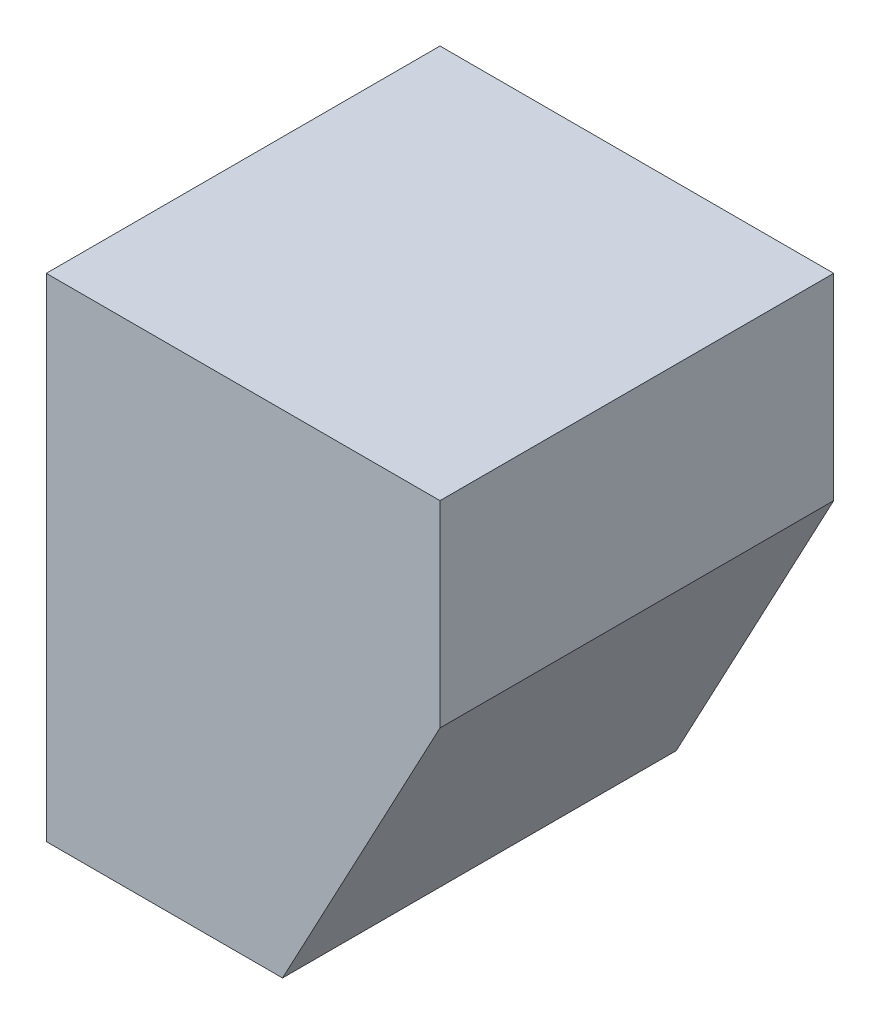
ISO-10303-21;
HEADER;
FILE_DESCRIPTION(('STEP AP214'),'2;1');
FILE_NAME('part.step','',(''),(''),'','','');
FILE_SCHEMA(('AUTOMOTIVE_DESIGN { 1 0 10303 214 1 1 1 1 }'));
ENDSEC;
DATA;
#1=APPLICATION_CONTEXT('core data for automotive mechanical design processes');
#2=APPLICATION_PROTOCOL_DEFINITION('international standard','automotive_design',2000,#1);
#3=PRODUCT_CONTEXT('',#1,'mechanical');
#4=PRODUCT('Part','Part','',(#3));
#5=PRODUCT_RELATED_PRODUCT_CATEGORY('part','',(#4));
#6=PRODUCT_DEFINITION_FORMATION('','',#4);
#7=PRODUCT_DEFINITION_CONTEXT('part definition',#1,'design');
#8=PRODUCT_DEFINITION('design','',#6,#7);
#9=PRODUCT_DEFINITION_SHAPE('','',#8);
#10=(LENGTH_UNIT() NAMED_UNIT(*) SI_UNIT(.MILLI.,.METRE.));
#11=(NAMED_UNIT(*) PLANE_ANGLE_UNIT() SI_UNIT($,.RADIAN.));
#12=(NAMED_UNIT(*) SI_UNIT($,.STERADIAN.) SOLID_ANGLE_UNIT());
#13=UNCERTAINTY_MEASURE_WITH_UNIT(LENGTH_MEASURE(1.E-05),#10,'distance_accuracy_value','');
#14=(GEOMETRIC_REPRESENTATION_CONTEXT(3) GLOBAL_UNCERTAINTY_ASSIGNED_CONTEXT((#13)) GLOBAL_UNIT_ASSIGNED_CONTEXT((#10,
#11,#12)) REPRESENTATION_CONTEXT('',''));
#15=CARTESIAN_POINT('',(0.,0.,0.));
#16=DIRECTION('',(0.,0.,1.));
#17=DIRECTION('',(1.,0.,0.));
#18=AXIS2_PLACEMENT_3D('',#15,#16,#17);
#19=CARTESIAN_POINT('',(-42.8205504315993,18.3170990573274,10.));
#20=DIRECTION('',(0.,1.,0.));
#21=DIRECTION('',(-1.,0.,0.));
#22=AXIS2_PLACEMENT_3D('',#19,#20,#21);
#23=PLANE('',#22);
#24=DIRECTION('',(1.,0.,0.));
#25=VECTOR('',#24,1.);
#26=CARTESIAN_POINT('',(-42.8205504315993,18.3170990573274,-10.));
#27=LINE('',#26,#25);
#28=CARTESIAN_POINT('',(-42.8205504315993,18.3170990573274,-10.));
#29=VERTEX_POINT('',#28);
#30=CARTESIAN_POINT('',(-30.8205504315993,18.3170990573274,-10.));
#31=VERTEX_POINT('',#30);
#32=EDGE_CURVE('E106',#29,#31,#27,.T.);
#33=ORIENTED_EDGE('',*,*,#32,.T.);
#34=DIRECTION('',(0.,0.,-1.));
#35=VECTOR('',#34,1.);
#36=CARTESIAN_POINT('',(-30.8205504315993,18.3170990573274,10.));
#37=LINE('',#36,#35);
#38=CARTESIAN_POINT('',(-30.8205504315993,18.3170990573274,10.));
#39=VERTEX_POINT('',#38);
#40=EDGE_CURVE('E11',#39,#31,#37,.T.);
#41=ORIENTED_EDGE('',*,*,#40,.F.);
#42=DIRECTION('',(1.,0.,0.));
#43=VECTOR('',#42,1.);
#44=CARTESIAN_POINT('',(-42.8205504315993,18.3170990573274,10.));
#45=LINE('',#44,#43);
#46=CARTESIAN_POINT('',(-42.8205504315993,18.3170990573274,10.));
#47=VERTEX_POINT('',#46);
#48=EDGE_CURVE('E114',#47,#39,#45,.T.);
#49=ORIENTED_EDGE('',*,*,#48,.F.);
#50=DIRECTION('',(0.,0.,-1.));
#51=VECTOR('',#50,1.);
#52=CARTESIAN_POINT('',(-42.8205504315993,18.3170990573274,10.));
#53=LINE('',#52,#51);
#54=EDGE_CURVE('E102',#47,#29,#53,.T.);
#55=ORIENTED_EDGE('',*,*,#54,.T.);
#56=EDGE_LOOP('',(#33,#41,#49,#55));
#57=FACE_BOUND('',#56,.T.);
#58=ADVANCED_FACE('F32',(#57),#23,.F.);
#59=CARTESIAN_POINT('',(-30.8205504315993,18.3170990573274,10.));
#60=DIRECTION('',(-0.882352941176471,0.470588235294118,0.));
#61=DIRECTION('',(-0.470588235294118,-0.882352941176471,0.));
#62=AXIS2_PLACEMENT_3D('',#59,#60,#61);
#63=PLANE('',#62);
#64=DIRECTION('',(0.470588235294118,0.882352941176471,0.));
#65=VECTOR('',#64,1.);
#66=CARTESIAN_POINT('',(-30.8205504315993,18.3170990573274,-10.));
#67=LINE('',#66,#65);
#68=CARTESIAN_POINT('',(-22.8205504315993,33.3170990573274,-10.));
#69=VERTEX_POINT('',#68);
#70=EDGE_CURVE('E109',#31,#69,#67,.T.);
#71=ORIENTED_EDGE('',*,*,#70,.T.);
#72=DIRECTION('',(0.,0.,-1.));
#73=VECTOR('',#72,1.);
#74=CARTESIAN_POINT('',(-22.8205504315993,33.3170990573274,10.));
#75=LINE('',#74,#73);
#76=CARTESIAN_POINT('',(-22.8205504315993,33.3170990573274,10.));
#77=VERTEX_POINT('',#76);
#78=EDGE_CURVE('E40',#77,#69,#75,.T.);
#79=ORIENTED_EDGE('',*,*,#78,.F.);
#80=DIRECTION('',(0.470588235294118,0.882352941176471,0.));
#81=VECTOR('',#80,1.);
#82=CARTESIAN_POINT('',(-30.8205504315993,18.3170990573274,10.));
#83=LINE('',#82,#81);
#84=EDGE_CURVE('E82',#39,#77,#83,.T.);
#85=ORIENTED_EDGE('',*,*,#84,.F.);
#86=ORIENTED_EDGE('',*,*,#40,.T.);
#87=EDGE_LOOP('',(#71,#79,#85,#86));
#88=FACE_BOUND('',#87,.T.);
#89=ADVANCED_FACE('F133',(#88),#63,.F.);
#90=CARTESIAN_POINT('',(-22.8205504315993,33.3170990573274,10.));
#91=DIRECTION('',(-1.,0.,0.));
#92=DIRECTION('',(0.,0.,1.));
#93=AXIS2_PLACEMENT_3D('',#90,#91,#92);
#94=PLANE('',#93);
#95=DIRECTION('',(0.,1.,0.));
#96=VECTOR('',#95,1.);
#97=CARTESIAN_POINT('',(-22.8205504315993,33.3170990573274,-10.));
#98=LINE('',#97,#96);
#99=CARTESIAN_POINT('',(-22.8205504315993,43.3170990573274,-10.));
#100=VERTEX_POINT('',#99);
#101=EDGE_CURVE('E97',#69,#100,#98,.T.);
#102=ORIENTED_EDGE('',*,*,#101,.T.);
#103=DIRECTION('',(0.,0.,-1.));
#104=VECTOR('',#103,1.);
#105=CARTESIAN_POINT('',(-22.8205504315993,43.3170990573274,10.));
#106=LINE('',#105,#104);
#107=CARTESIAN_POINT('',(-22.8205504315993,43.3170990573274,10.));
#108=VERTEX_POINT('',#107);
#109=EDGE_CURVE('E94',#108,#100,#106,.T.);
#110=ORIENTED_EDGE('',*,*,#109,.F.);
#111=DIRECTION('',(0.,1.,0.));
#112=VECTOR('',#111,1.);
#113=CARTESIAN_POINT('',(-22.8205504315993,33.3170990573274,10.));
#114=LINE('',#113,#112);
#115=EDGE_CURVE('E86',#77,#108,#114,.T.);
#116=ORIENTED_EDGE('',*,*,#115,.F.);
#117=ORIENTED_EDGE('',*,*,#78,.T.);
#118=EDGE_LOOP('',(#102,#110,#116,#117));
#119=FACE_BOUND('',#118,.T.);
#120=ADVANCED_FACE('F95',(#119),#94,.F.);
#121=CARTESIAN_POINT('',(-22.8205504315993,43.3170990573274,10.));
#122=DIRECTION('',(0.,-1.,0.));
#123=DIRECTION('',(0.,0.,-1.));
#124=AXIS2_PLACEMENT_3D('',#121,#122,#123);
#125=PLANE('',#124);
#126=DIRECTION('',(-1.,0.,0.));
#127=VECTOR('',#126,1.);
#128=CARTESIAN_POINT('',(-22.8205504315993,43.3170990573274,-10.));
#129=LINE('',#128,#127);
#130=CARTESIAN_POINT('',(-42.8205504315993,43.3170990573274,-10.));
#131=VERTEX_POINT('',#130);
#132=EDGE_CURVE('E68',#100,#131,#129,.T.);
#133=ORIENTED_EDGE('',*,*,#132,.T.);
#134=DIRECTION('',(0.,0.,-1.));
#135=VECTOR('',#134,1.);
#136=CARTESIAN_POINT('',(-42.8205504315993,43.3170990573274,10.));
#137=LINE('',#136,#135);
#138=CARTESIAN_POINT('',(-42.8205504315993,43.3170990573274,10.));
#139=VERTEX_POINT('',#138);
#140=EDGE_CURVE('E98',#139,#131,#137,.T.);
#141=ORIENTED_EDGE('',*,*,#140,.F.);
#142=DIRECTION('',(-1.,0.,0.));
#143=VECTOR('',#142,1.);
#144=CARTESIAN_POINT('',(-22.8205504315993,43.3170990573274,10.));
#145=LINE('',#144,#143);
#146=EDGE_CURVE('E90',#108,#139,#145,.T.);
#147=ORIENTED_EDGE('',*,*,#146,.F.);
#148=ORIENTED_EDGE('',*,*,#109,.T.);
#149=EDGE_LOOP('',(#133,#141,#147,#148));
#150=FACE_BOUND('',#149,.T.);
#151=ADVANCED_FACE('F100',(#150),#125,.F.);
#152=CARTESIAN_POINT('',(-42.8205504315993,43.3170990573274,10.));
#153=DIRECTION('',(1.,0.,0.));
#154=DIRECTION('',(0.,1.,0.));
#155=AXIS2_PLACEMENT_3D('',#152,#153,#154);
#156=PLANE('',#155);
#157=DIRECTION('',(0.,-1.,0.));
#158=VECTOR('',#157,1.);
#159=CARTESIAN_POINT('',(-42.8205504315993,43.3170990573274,-10.));
#160=LINE('',#159,#158);
#161=EDGE_CURVE('E74',#131,#29,#160,.T.);
#162=ORIENTED_EDGE('',*,*,#161,.T.);
#163=ORIENTED_EDGE('',*,*,#54,.F.);
#164=DIRECTION('',(0.,-1.,0.));
#165=VECTOR('',#164,1.);
#166=CARTESIAN_POINT('',(-42.8205504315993,43.3170990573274,10.));
#167=LINE('',#166,#165);
#168=EDGE_CURVE('E48',#139,#47,#167,.T.);
#169=ORIENTED_EDGE('',*,*,#168,.F.);
#170=ORIENTED_EDGE('',*,*,#140,.T.);
#171=EDGE_LOOP('',(#162,#163,#169,#170));
#172=FACE_BOUND('',#171,.T.);
#173=ADVANCED_FACE('F122',(#172),#156,.F.);
#174=CARTESIAN_POINT('',(0.,0.,10.));
#175=DIRECTION('',(0.,0.,1.));
#176=DIRECTION('',(1.,0.,0.));
#177=AXIS2_PLACEMENT_3D('',#174,#175,#176);
#178=PLANE('',#177);
#179=ORIENTED_EDGE('',*,*,#48,.T.);
#180=ORIENTED_EDGE('',*,*,#84,.T.);
#181=ORIENTED_EDGE('',*,*,#115,.T.);
#182=ORIENTED_EDGE('',*,*,#146,.T.);
#183=ORIENTED_EDGE('',*,*,#168,.T.);
#184=EDGE_LOOP('',(#179,#180,#181,#182,#183));
#185=FACE_BOUND('',#184,.T.);
#186=ADVANCED_FACE('F88',(#185),#178,.T.);
#187=CARTESIAN_POINT('',(0.,0.,-10.));
#188=DIRECTION('',(0.,0.,1.));
#189=DIRECTION('',(1.,0.,0.));
#190=AXIS2_PLACEMENT_3D('',#187,#188,#189);
#191=PLANE('',#190);
#192=ORIENTED_EDGE('',*,*,#32,.F.);
#193=ORIENTED_EDGE('',*,*,#161,.F.);
#194=ORIENTED_EDGE('',*,*,#132,.F.);
#195=ORIENTED_EDGE('',*,*,#101,.F.);
#196=ORIENTED_EDGE('',*,*,#70,.F.);
#197=EDGE_LOOP('',(#192,#193,#194,#195,#196));
#198=FACE_BOUND('',#197,.T.);
#199=ADVANCED_FACE('F118',(#198),#191,.F.);
#200=CLOSED_SHELL('',(#58,#89,#120,#151,#173,#186,#199));
#201=MANIFOLD_SOLID_BREP('B2',#200);
#202=ADVANCED_BREP_SHAPE_REPRESENTATION('',(#18,#201),#14);
#203=SHAPE_DEFINITION_REPRESENTATION(#9,#202);
ENDSEC;
END-ISO-10303-21;
